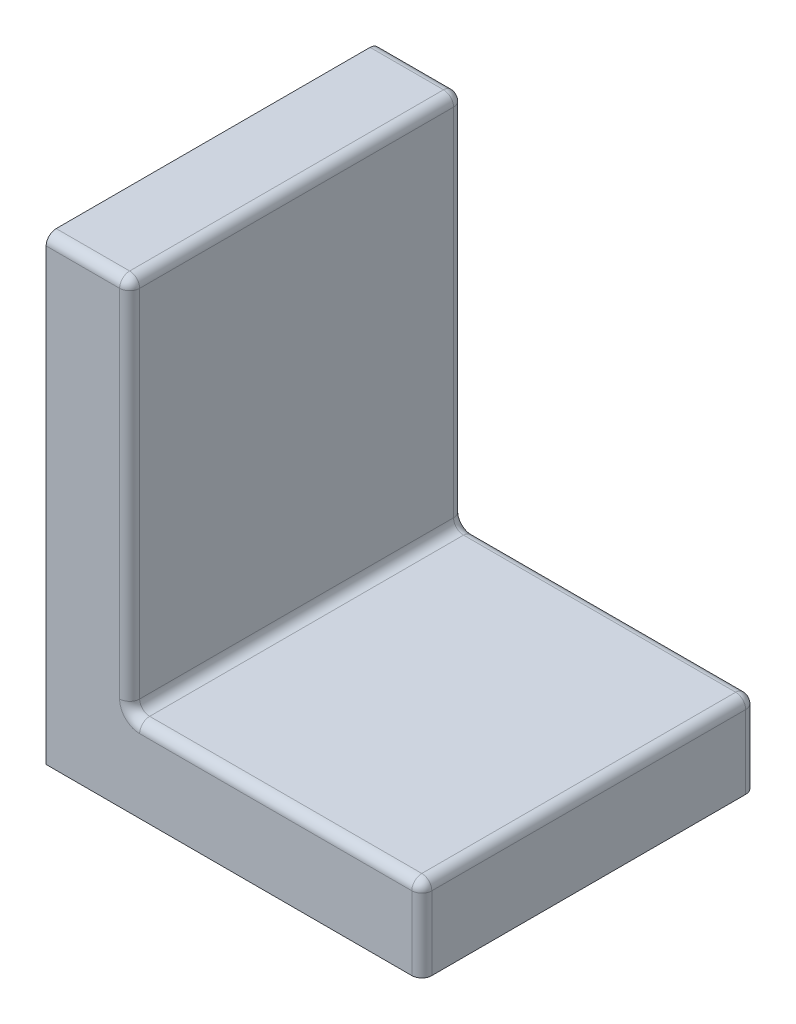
from build123d import *

# Parameters (mm, degrees)
EXTRUDE1_DEPTH    = 25.4
INTERIOR_FILLET_R = 1.524
FILLET2_R         = 1.524
FILLET3_R         = 1.524


with BuildPart() as part:
    # Sketch1 → Extrude1 (new, symmetric)
    with BuildSketch(Plane.XY):
        Polygon((0, 69.85), (0, 0), (57.15, 0), (57.15, 12.7), (12.7, 12.7), (12.7, 69.85), align=None)
    extrude(amount=EXTRUDE1_DEPTH, both=True)

    # Interior Fillet
    interior_fillet_edges = [part.edges().sort_by_distance(p)[0] for p in [
        (12.7, 12.7, 0),
    ]]
    fillet(interior_fillet_edges, radius=INTERIOR_FILLET_R)

    # Fillet2
    fillet2_edges = [part.edges().sort_by_distance(p)[0] for p in [
        (57.15, 6.35, 25.4),
        (6.35, 69.85, 25.4),
        (57.15, 6.35, -25.4),
        (6.35, 69.85, -25.4),
    ]]
    fillet(fillet2_edges, radius=FILLET2_R)

    # Fillet3
    fillet3_edges = [part.edges().sort_by_distance(p)[0] for p in [
        (12.7, 41.275, -25.4),
        (12.7, 41.275, 25.4),
        (13.146369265, 13.146369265, -25.4),
        (13.146369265, 13.146369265, 25.4),
        (57.15, 12.7, 0),
        (34.925, 12.7, -25.4),
        (34.925, 12.7, 25.4),
        (56.703630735, 12.7, 24.953630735),
        (56.703630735, 12.7, -24.953630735),
        (12.7, 69.85, 0),
        (12.7, 69.403630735, 24.953630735),
        (12.7, 69.403630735, -24.953630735),
    ]]
    fillet(fillet3_edges, radius=FILLET3_R)


solid = part.part
